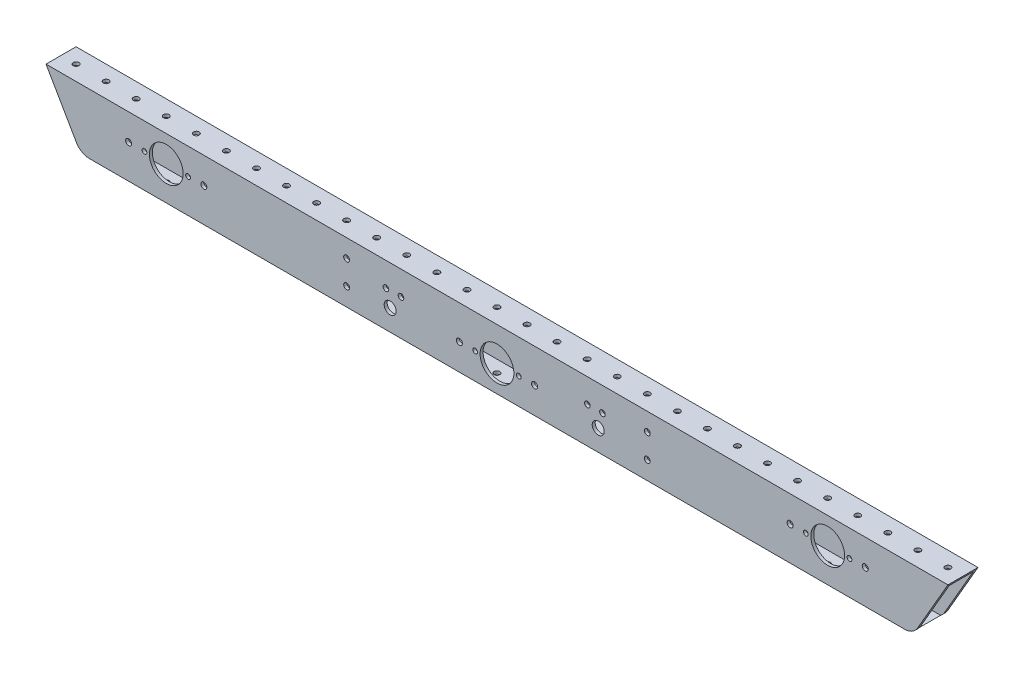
from build123d import *

# Parameters (mm, degrees)
SKETCH1_W           = 762
SKETCH1_H           = 50.8
SKETCH1_R           = 14.2748
BOSS_EXTRUDE1_DEPTH = 25.4
SKETCH2_W           = 20.32
SKETCH2_H           = 45.72
CUT_EXTRUDE1_DEPTH  = 763.846196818
SKETCH3_R           = 2.38125
CUT_EXTRUDE2_DEPTH  = 386.210072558
CUT_EXTRUDE3_DEPTH  = 383.689587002
SKETCH6_R           = 2.4892
CUT_EXTRUDE4_DEPTH  = 383.689587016
SKETCH7_R           = 5.08
SKETCH7_R_2         = 2.38125
SKETCH7_R_3         = 2.4892
CUT_EXTRUDE5_DEPTH  = 383.689587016
SKETCH9_R           = 2.5527
SKETCH9_R_2         = 2.0193
CUT_EXTRUDE6_DEPTH  = 383.689587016


with BuildPart() as part:
    # Sketch1 → Boss-Extrude1 (new body)
    with BuildSketch(Plane.XY):
        Rectangle(SKETCH1_W, SKETCH1_H)
        with Locations((-279.4, 3.175)):
            Circle(SKETCH1_R, mode=Mode.SUBTRACT)
        with Locations((0, -3.175)):
            Circle(SKETCH1_R, mode=Mode.SUBTRACT)
        with Locations((279.4, 3.175)):
            Circle(SKETCH1_R, mode=Mode.SUBTRACT)
    extrude(amount=BOSS_EXTRUDE1_DEPTH)

    # Sketch2 → Cut-Extrude1 (cut, through all)
    with BuildSketch(Plane(origin=(381, 0, 0), x_dir=(0, 0, -1), z_dir=(1, 0, 0))):
        with Locations((-12.7, 0)):
            Rectangle(SKETCH2_W, SKETCH2_H)
    extrude(amount=-CUT_EXTRUDE1_DEPTH, mode=Mode.SUBTRACT)

    # Sketch3 → Cut-Extrude2 (cut, through all)
    with BuildSketch(Plane(origin=(0, 25.4, 0), x_dir=(1, 0, 0), z_dir=(0, 1, 0))):
        with Locations(Location((-368.3, -12.7, 0), (0, 0, 270))):
            Circle(SKETCH3_R)
        with Locations(Location((-342.9, -12.7, 0), (0, 0, 270))):
            Circle(SKETCH3_R)
        with Locations(Location((-317.5, -12.7, 0), (0, 0, 270))):
            Circle(SKETCH3_R)
        with Locations(Location((-292.1, -12.7, 0), (0, 0, 270))):
            Circle(SKETCH3_R)
        with Locations(Location((-266.7, -12.7, 0), (0, 0, 270))):
            Circle(SKETCH3_R)
        with Locations(Location((-241.3, -12.7, 0), (0, 0, 270))):
            Circle(SKETCH3_R)
        with Locations(Location((-215.9, -12.7, 0), (0, 0, 270))):
            Circle(SKETCH3_R)
        with Locations(Location((-190.5, -12.7, 0), (0, 0, 270))):
            Circle(SKETCH3_R)
        with Locations(Location((-165.1, -12.7, 0), (0, 0, 270))):
            Circle(SKETCH3_R)
        with Locations(Location((-139.7, -12.7, 0), (0, 0, 270))):
            Circle(SKETCH3_R)
        with Locations(Location((-114.3, -12.7, 0), (0, 0, 270))):
            Circle(SKETCH3_R)
        with Locations(Location((-88.9, -12.7, 0), (0, 0, 270))):
            Circle(SKETCH3_R)
        with Locations(Location((-63.5, -12.7, 0), (0, 0, 270))):
            Circle(SKETCH3_R)
        with Locations(Location((-38.1, -12.7, 0), (0, 0, 270))):
            Circle(SKETCH3_R)
        with Locations(Location((-12.7, -12.7, 0), (0, 0, 270))):
            Circle(SKETCH3_R)
        with Locations(Location((12.7, -12.7, 0), (0, 0, 270))):
            Circle(SKETCH3_R)
        with Locations(Location((38.1, -12.7, 0), (0, 0, 270))):
            Circle(SKETCH3_R)
        with Locations(Location((63.5, -12.7, 0), (0, 0, 270))):
            Circle(SKETCH3_R)
        with Locations(Location((88.9, -12.7, 0), (0, 0, 270))):
            Circle(SKETCH3_R)
        with Locations(Location((114.3, -12.7, 0), (0, 0, 270))):
            Circle(SKETCH3_R)
        with Locations(Location((139.7, -12.7, 0), (0, 0, 270))):
            Circle(SKETCH3_R)
        with Locations(Location((165.1, -12.7, 0), (0, 0, 270))):
            Circle(SKETCH3_R)
        with Locations(Location((190.5, -12.7, 0), (0, 0, 270))):
            Circle(SKETCH3_R)
        with Locations(Location((215.9, -12.7, 0), (0, 0, 270))):
            Circle(SKETCH3_R)
        with Locations(Location((241.3, -12.7, 0), (0, 0, 270))):
            Circle(SKETCH3_R)
        with Locations(Location((266.7, -12.7, 0), (0, 0, 270))):
            Circle(SKETCH3_R)
        with Locations(Location((292.1, -12.7, 0), (0, 0, 270))):
            Circle(SKETCH3_R)
        with Locations(Location((317.5, -12.7, 0), (0, 0, 270))):
            Circle(SKETCH3_R)
        with Locations(Location((342.9, -12.7, 0), (0, 0, 270))):
            Circle(SKETCH3_R)
        with Locations(Location((368.3, -12.7, 0), (0, 0, 270))):
            Circle(SKETCH3_R)
    extrude(amount=-CUT_EXTRUDE2_DEPTH, mode=Mode.SUBTRACT)

    # Sketch4 → Cut-Extrude3 (cut, through all)
    with BuildSketch(Plane.XY.offset(25.4)):
        with BuildLine():
            Line((-381, 25.4), (-355.336780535, -19.05))
            ThreePointArc((-355.336780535, -19.05), (-350.688257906, -23.698522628), (-344.338257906, -25.4))
            Line((-344.338257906, -25.4), (344.338257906, -25.4))
            ThreePointArc((344.338257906, -25.4), (350.688257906, -23.698522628), (355.336780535, -19.05))
            Line((355.336780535, -19.05), (381, 25.4))
            Line((381, 25.4), (381, -96.595374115))
            Line((381, -96.595374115), (-381, -96.595374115))
            Line((-381, -96.595374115), (-381, 25.4))
        make_face()
    extrude(amount=-CUT_EXTRUDE3_DEPTH, mode=Mode.SUBTRACT)

    # Sketch6 → Cut-Extrude4 (cut, through all)
    with BuildSketch(Plane.XY.offset(25.4)):
        with Locations((127, 10.16)):
            Circle(SKETCH6_R)
        with Locations((127, -10.16)):
            Circle(SKETCH6_R)
    cut_extrude4 = extrude(amount=-CUT_EXTRUDE4_DEPTH, mode=Mode.SUBTRACT)

    # Mirror1: Cut-Extrude4 across plane
    add(cut_extrude4.mirror(Plane(origin=(0, 0, 0), x_dir=(0, 0, 1), z_dir=(1, 0, 0))), mode=Mode.SUBTRACT)

    # Sketch7 → Cut-Extrude5 (cut, through all)
    # profile 1 of 7: a face of its own
    with BuildSketch(Plane.XY.offset(25.4)):
        with Locations((-90.231995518, -7.617706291)):
            Circle(SKETCH7_R)
    # profile 2 of 7: a face of its own
    with BuildSketch(Plane.XY.offset(25.4)):
        with Locations((-81.087995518, 5.082293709)):
            Circle(SKETCH7_R_2)
    # profile 3 of 7: a face of its own
    with BuildSketch(Plane.XY.offset(25.4)):
        with Locations((-93.787995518, 5.082293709)):
            Circle(SKETCH7_R_2)
    # profile 4 of 7: a face of its own
    with BuildSketch(Plane.XY.offset(25.4)):
        with Locations((76.392004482, 5.082293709)):
            Circle(SKETCH7_R_2)
    # profile 5 of 7: a face of its own
    with BuildSketch(Plane.XY.offset(25.4)):
        with Locations((89.092004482, 5.082293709)):
            Circle(SKETCH7_R_2)
    # profile 6 of 7: a face of its own
    with BuildSketch(Plane.XY.offset(25.4)):
        with Locations((85.536004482, -7.617706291)):
            Circle(SKETCH7_R)
        with Locations((85.536004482, -7.617706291)):
            Circle(SKETCH7_R_3, mode=Mode.SUBTRACT)
    # profile 7 of 7: a face of its own
    with BuildSketch(Plane.XY.offset(25.4)):
        with Locations((85.536004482, -7.617706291)):
            Circle(SKETCH7_R_3)
    extrude(amount=-CUT_EXTRUDE5_DEPTH, mode=Mode.SUBTRACT)

    # Sketch9 → Cut-Extrude6 (cut, through all)
    with BuildSketch(Plane.XY.offset(25.4)):
        with Locations((-311.15, 3.175)):
            Circle(SKETCH9_R)
        with Locations((-247.65, 3.175)):
            Circle(SKETCH9_R)
        with Locations((-31.75, -3.175)):
            Circle(SKETCH9_R)
        with Locations((31.75, -3.175)):
            Circle(SKETCH9_R)
        with Locations((247.65, 3.175)):
            Circle(SKETCH9_R)
        with Locations((311.15, 3.175)):
            Circle(SKETCH9_R)
        with Locations((-297.8277, 3.175)):
            Circle(SKETCH9_R_2)
        with Locations((-260.9723, 3.175)):
            Circle(SKETCH9_R_2)
        with Locations((-18.4277, -3.175)):
            Circle(SKETCH9_R_2)
        with Locations((18.4277, -3.175)):
            Circle(SKETCH9_R_2)
        with Locations((260.9723, 3.175)):
            Circle(SKETCH9_R_2)
        with Locations((297.8277, 3.175)):
            Circle(SKETCH9_R_2)
    extrude(amount=-CUT_EXTRUDE6_DEPTH, mode=Mode.SUBTRACT)


solid = part.part
